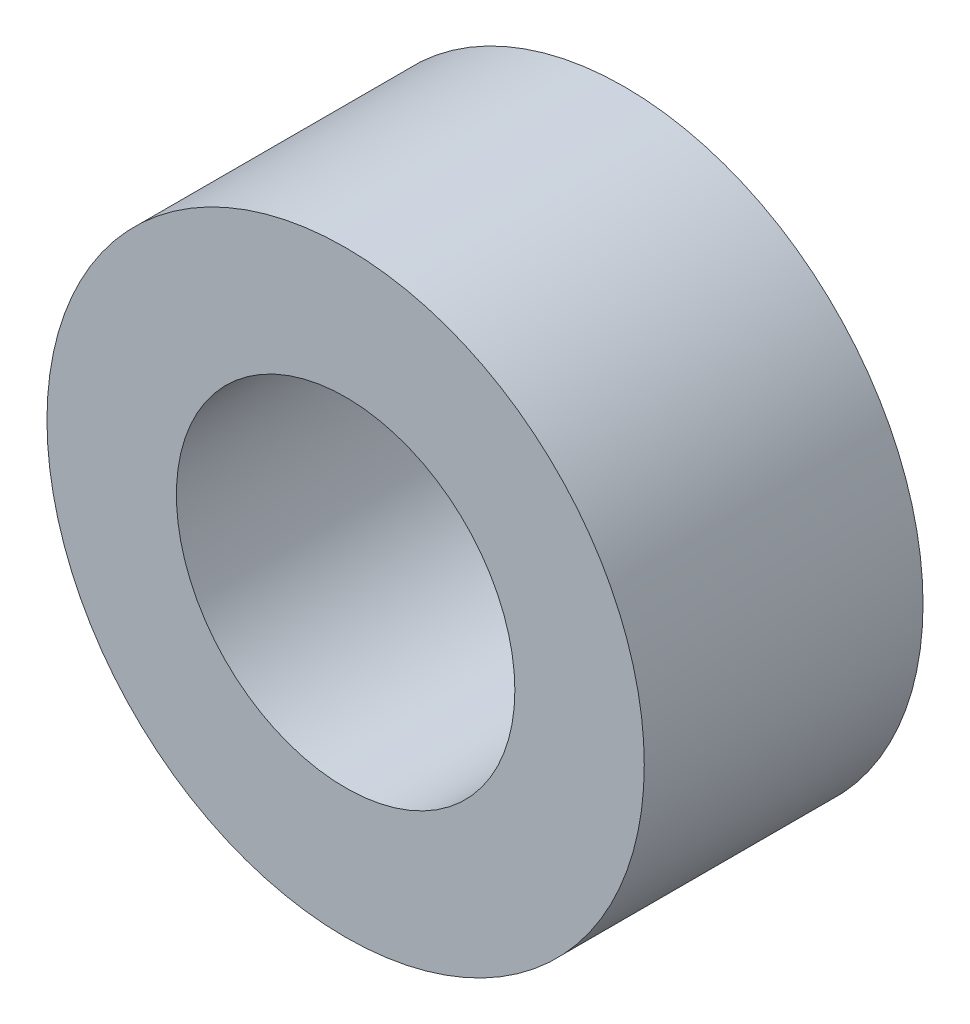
ISO-10303-21;
HEADER;
FILE_DESCRIPTION(('STEP AP214'),'2;1');
FILE_NAME('part.step','',(''),(''),'','','');
FILE_SCHEMA(('AUTOMOTIVE_DESIGN { 1 0 10303 214 1 1 1 1 }'));
ENDSEC;
DATA;
#1=APPLICATION_CONTEXT('core data for automotive mechanical design processes');
#2=APPLICATION_PROTOCOL_DEFINITION('international standard','automotive_design',2000,#1);
#3=PRODUCT_CONTEXT('',#1,'mechanical');
#4=PRODUCT('Part','Part','',(#3));
#5=PRODUCT_RELATED_PRODUCT_CATEGORY('part','',(#4));
#6=PRODUCT_DEFINITION_FORMATION('','',#4);
#7=PRODUCT_DEFINITION_CONTEXT('part definition',#1,'design');
#8=PRODUCT_DEFINITION('design','',#6,#7);
#9=PRODUCT_DEFINITION_SHAPE('','',#8);
#10=(LENGTH_UNIT() NAMED_UNIT(*) SI_UNIT(.MILLI.,.METRE.));
#11=(NAMED_UNIT(*) PLANE_ANGLE_UNIT() SI_UNIT($,.RADIAN.));
#12=(NAMED_UNIT(*) SI_UNIT($,.STERADIAN.) SOLID_ANGLE_UNIT());
#13=UNCERTAINTY_MEASURE_WITH_UNIT(LENGTH_MEASURE(1.E-05),#10,'distance_accuracy_value','');
#14=(GEOMETRIC_REPRESENTATION_CONTEXT(3) GLOBAL_UNCERTAINTY_ASSIGNED_CONTEXT((#13)) GLOBAL_UNIT_ASSIGNED_CONTEXT((#10,
#11,#12)) REPRESENTATION_CONTEXT('',''));
#15=CARTESIAN_POINT('',(0.,0.,0.));
#16=DIRECTION('',(0.,0.,1.));
#17=DIRECTION('',(1.,0.,0.));
#18=AXIS2_PLACEMENT_3D('',#15,#16,#17);
#19=CARTESIAN_POINT('',(0.,0.,2.8));
#20=DIRECTION('',(0.,0.,1.));
#21=DIRECTION('',(1.,0.,0.));
#22=AXIS2_PLACEMENT_3D('',#19,#20,#21);
#23=PLANE('',#22);
#24=CARTESIAN_POINT('',(0.,0.,2.8));
#25=DIRECTION('',(0.,0.,1.));
#26=DIRECTION('',(1.,0.,0.));
#27=AXIS2_PLACEMENT_3D('',#24,#25,#26);
#28=CIRCLE('',#27,3.);
#29=CARTESIAN_POINT('',(3.,0.,2.8));
#30=VERTEX_POINT('',#29);
#31=EDGE_CURVE('E10',#30,#30,#28,.T.);
#32=ORIENTED_EDGE('',*,*,#31,.T.);
#33=EDGE_LOOP('',(#32));
#34=FACE_BOUND('',#33,.T.);
#35=CARTESIAN_POINT('',(0.,0.,2.8));
#36=DIRECTION('',(0.,0.,1.));
#37=DIRECTION('',(1.,0.,0.));
#38=AXIS2_PLACEMENT_3D('',#35,#36,#37);
#39=CIRCLE('',#38,1.7);
#40=CARTESIAN_POINT('',(1.7,0.,2.8));
#41=VERTEX_POINT('',#40);
#42=EDGE_CURVE('E41',#41,#41,#39,.T.);
#43=ORIENTED_EDGE('',*,*,#42,.F.);
#44=EDGE_LOOP('',(#43));
#45=FACE_BOUND('',#44,.T.);
#46=ADVANCED_FACE('F30',(#34,#45),#23,.T.);
#47=CARTESIAN_POINT('',(0.,0.,0.));
#48=DIRECTION('',(0.,0.,1.));
#49=DIRECTION('',(1.,0.,0.));
#50=AXIS2_PLACEMENT_3D('',#47,#48,#49);
#51=PLANE('',#50);
#52=CARTESIAN_POINT('',(0.,0.,0.));
#53=DIRECTION('',(0.,0.,1.));
#54=DIRECTION('',(1.,0.,0.));
#55=AXIS2_PLACEMENT_3D('',#52,#53,#54);
#56=CIRCLE('',#55,3.);
#57=CARTESIAN_POINT('',(3.,0.,0.));
#58=VERTEX_POINT('',#57);
#59=EDGE_CURVE('E34',#58,#58,#56,.T.);
#60=ORIENTED_EDGE('',*,*,#59,.F.);
#61=EDGE_LOOP('',(#60));
#62=FACE_BOUND('',#61,.T.);
#63=CARTESIAN_POINT('',(0.,0.,0.));
#64=DIRECTION('',(0.,0.,1.));
#65=DIRECTION('',(1.,0.,0.));
#66=AXIS2_PLACEMENT_3D('',#63,#64,#65);
#67=CIRCLE('',#66,1.7);
#68=CARTESIAN_POINT('',(1.7,0.,0.));
#69=VERTEX_POINT('',#68);
#70=EDGE_CURVE('E43',#69,#69,#67,.T.);
#71=ORIENTED_EDGE('',*,*,#70,.T.);
#72=EDGE_LOOP('',(#71));
#73=FACE_BOUND('',#72,.T.);
#74=ADVANCED_FACE('F53',(#62,#73),#51,.F.);
#75=CARTESIAN_POINT('',(0.,0.,2.8));
#76=DIRECTION('',(0.,0.,-1.));
#77=DIRECTION('',(-1.,0.,0.));
#78=AXIS2_PLACEMENT_3D('',#75,#76,#77);
#79=CYLINDRICAL_SURFACE('',#78,3.);
#80=ORIENTED_EDGE('',*,*,#31,.F.);
#81=EDGE_LOOP('',(#80));
#82=FACE_BOUND('',#81,.T.);
#83=ORIENTED_EDGE('',*,*,#59,.T.);
#84=EDGE_LOOP('',(#83));
#85=FACE_BOUND('',#84,.T.);
#86=ADVANCED_FACE('F32',(#82,#85),#79,.T.);
#87=CARTESIAN_POINT('',(0.,0.,2.8));
#88=DIRECTION('',(0.,0.,-1.));
#89=DIRECTION('',(-1.,0.,0.));
#90=AXIS2_PLACEMENT_3D('',#87,#88,#89);
#91=CYLINDRICAL_SURFACE('',#90,1.7);
#92=ORIENTED_EDGE('',*,*,#42,.T.);
#93=EDGE_LOOP('',(#92));
#94=FACE_BOUND('',#93,.T.);
#95=ORIENTED_EDGE('',*,*,#70,.F.);
#96=EDGE_LOOP('',(#95));
#97=FACE_BOUND('',#96,.T.);
#98=ADVANCED_FACE('F49',(#94,#97),#91,.F.);
#99=CLOSED_SHELL('',(#46,#74,#86,#98));
#100=MANIFOLD_SOLID_BREP('B2',#99);
#101=ADVANCED_BREP_SHAPE_REPRESENTATION('',(#18,#100),#14);
#102=SHAPE_DEFINITION_REPRESENTATION(#9,#101);
ENDSEC;
END-ISO-10303-21;
